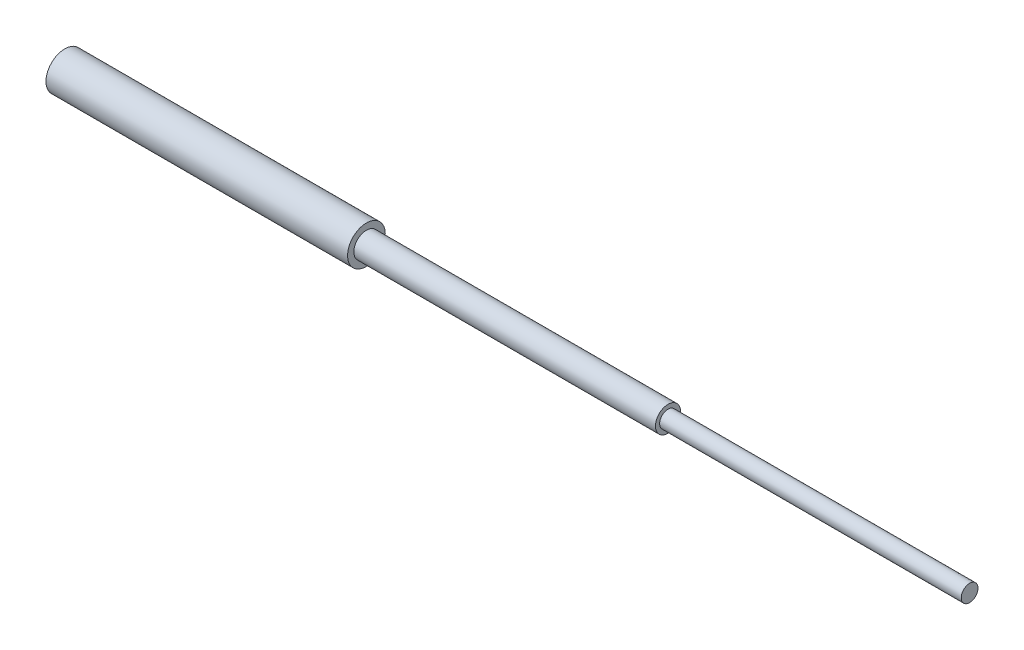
from build123d import *

# Parameters (mm, degrees)
SKETCH1_R      = 28.575
EXTRUDE1_DEPTH = 457.2
SKETCH2_R      = 19.05
EXTRUDE2_DEPTH = 457.2
SKETCH4_R      = 12.7
EXTRUDE3_DEPTH = 457.2


with BuildPart() as part:
    # Sketch1 → Extrude1 (new body)
    with BuildSketch(Plane(origin=(0, 0, 0), x_dir=(0, 0, -1), z_dir=(1, 0, 0))):
        Circle(SKETCH1_R)
    extrude(amount=EXTRUDE1_DEPTH)

    # Sketch2 → Extrude2 (add)
    with BuildSketch(Plane(origin=(457.2, 0, 0), x_dir=(0, 0, -1), z_dir=(1, 0, 0))):
        Circle(SKETCH2_R)
    extrude(amount=EXTRUDE2_DEPTH)

    # Sketch4 → Extrude3 (add)
    with BuildSketch(Plane(origin=(914.4, 0, 0), x_dir=(0, 0, -1), z_dir=(1, 0, 0))):
        Circle(SKETCH4_R)
    extrude(amount=EXTRUDE3_DEPTH)


solid = part.part
